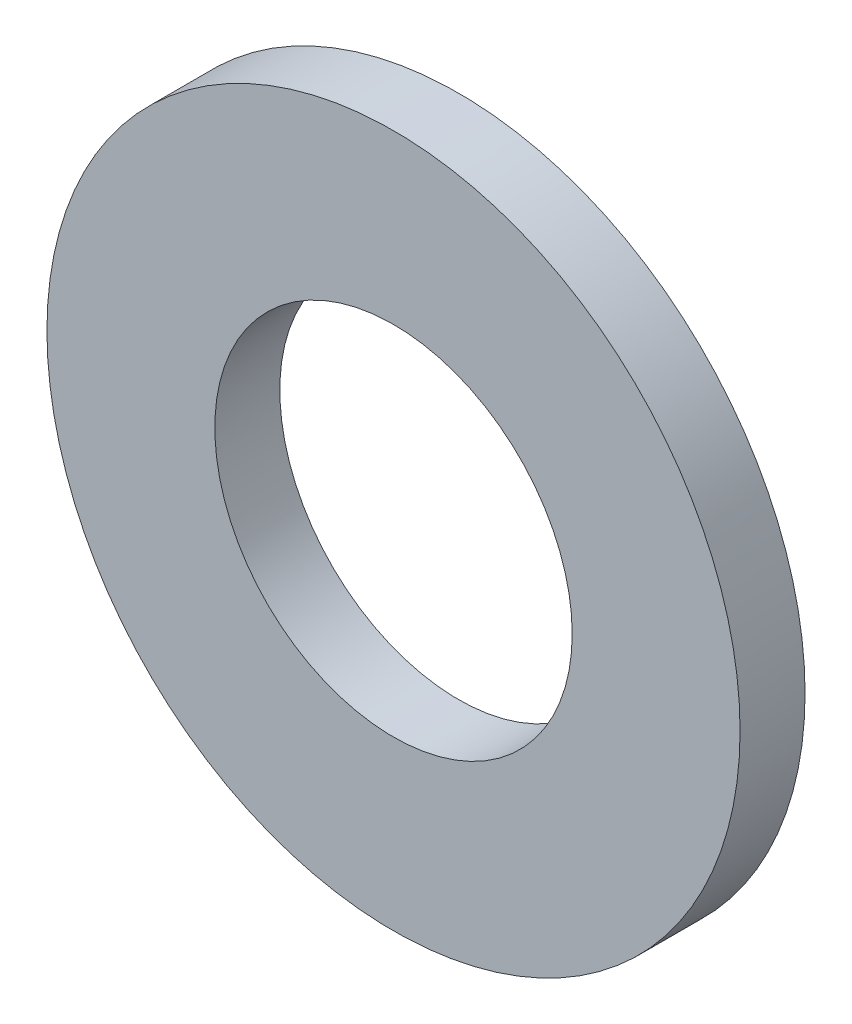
ISO-10303-21;
HEADER;
FILE_DESCRIPTION(('STEP AP214'),'2;1');
FILE_NAME('part.step','',(''),(''),'','','');
FILE_SCHEMA(('AUTOMOTIVE_DESIGN { 1 0 10303 214 1 1 1 1 }'));
ENDSEC;
DATA;
#1=APPLICATION_CONTEXT('core data for automotive mechanical design processes');
#2=APPLICATION_PROTOCOL_DEFINITION('international standard','automotive_design',2000,#1);
#3=PRODUCT_CONTEXT('',#1,'mechanical');
#4=PRODUCT('Part','Part','',(#3));
#5=PRODUCT_RELATED_PRODUCT_CATEGORY('part','',(#4));
#6=PRODUCT_DEFINITION_FORMATION('','',#4);
#7=PRODUCT_DEFINITION_CONTEXT('part definition',#1,'design');
#8=PRODUCT_DEFINITION('design','',#6,#7);
#9=PRODUCT_DEFINITION_SHAPE('','',#8);
#10=(LENGTH_UNIT() NAMED_UNIT(*) SI_UNIT(.MILLI.,.METRE.));
#11=(NAMED_UNIT(*) PLANE_ANGLE_UNIT() SI_UNIT($,.RADIAN.));
#12=(NAMED_UNIT(*) SI_UNIT($,.STERADIAN.) SOLID_ANGLE_UNIT());
#13=UNCERTAINTY_MEASURE_WITH_UNIT(LENGTH_MEASURE(1.E-05),#10,'distance_accuracy_value','');
#14=(GEOMETRIC_REPRESENTATION_CONTEXT(3) GLOBAL_UNCERTAINTY_ASSIGNED_CONTEXT((#13)) GLOBAL_UNIT_ASSIGNED_CONTEXT((#10,
#11,#12)) REPRESENTATION_CONTEXT('',''));
#15=CARTESIAN_POINT('',(0.,0.,0.));
#16=DIRECTION('',(0.,0.,1.));
#17=DIRECTION('',(1.,0.,0.));
#18=AXIS2_PLACEMENT_3D('',#15,#16,#17);
#19=CARTESIAN_POINT('',(0.,0.,2.99999999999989));
#20=DIRECTION('',(0.,0.,1.));
#21=DIRECTION('',(1.,0.,0.));
#22=AXIS2_PLACEMENT_3D('',#19,#20,#21);
#23=PLANE('',#22);
#24=CARTESIAN_POINT('',(0.,0.,2.99999999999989));
#25=DIRECTION('',(0.,0.,1.));
#26=DIRECTION('',(1.,0.,0.));
#27=AXIS2_PLACEMENT_3D('',#24,#25,#26);
#28=CIRCLE('',#27,16.);
#29=CARTESIAN_POINT('',(16.,0.,2.99999999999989));
#30=VERTEX_POINT('',#29);
#31=EDGE_CURVE('E10',#30,#30,#28,.T.);
#32=ORIENTED_EDGE('',*,*,#31,.T.);
#33=EDGE_LOOP('',(#32));
#34=FACE_BOUND('',#33,.T.);
#35=CARTESIAN_POINT('',(0.,0.,2.99999999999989));
#36=DIRECTION('',(0.,0.,1.));
#37=DIRECTION('',(1.,0.,0.));
#38=AXIS2_PLACEMENT_3D('',#35,#36,#37);
#39=CIRCLE('',#38,8.25);
#40=CARTESIAN_POINT('',(8.25000000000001,0.,2.99999999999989));
#41=VERTEX_POINT('',#40);
#42=EDGE_CURVE('E50',#41,#41,#39,.T.);
#43=ORIENTED_EDGE('',*,*,#42,.F.);
#44=EDGE_LOOP('',(#43));
#45=FACE_BOUND('',#44,.T.);
#46=ADVANCED_FACE('F36',(#34,#45),#23,.T.);
#47=CARTESIAN_POINT('',(0.,0.,0.));
#48=DIRECTION('',(0.,0.,1.));
#49=DIRECTION('',(1.,0.,0.));
#50=AXIS2_PLACEMENT_3D('',#47,#48,#49);
#51=PLANE('',#50);
#52=CARTESIAN_POINT('',(0.,0.,0.));
#53=DIRECTION('',(0.,0.,1.));
#54=DIRECTION('',(1.,0.,0.));
#55=AXIS2_PLACEMENT_3D('',#52,#53,#54);
#56=CIRCLE('',#55,16.);
#57=CARTESIAN_POINT('',(16.,0.,0.));
#58=VERTEX_POINT('',#57);
#59=EDGE_CURVE('E44',#58,#58,#56,.T.);
#60=ORIENTED_EDGE('',*,*,#59,.F.);
#61=EDGE_LOOP('',(#60));
#62=FACE_BOUND('',#61,.T.);
#63=CARTESIAN_POINT('',(0.,0.,0.));
#64=DIRECTION('',(0.,0.,1.));
#65=DIRECTION('',(1.,0.,0.));
#66=AXIS2_PLACEMENT_3D('',#63,#64,#65);
#67=CIRCLE('',#66,8.25);
#68=CARTESIAN_POINT('',(8.25000000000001,0.,0.));
#69=VERTEX_POINT('',#68);
#70=EDGE_CURVE('E55',#69,#69,#67,.T.);
#71=ORIENTED_EDGE('',*,*,#70,.T.);
#72=EDGE_LOOP('',(#71));
#73=FACE_BOUND('',#72,.T.);
#74=ADVANCED_FACE('F61',(#62,#73),#51,.F.);
#75=CARTESIAN_POINT('',(0.,0.,2.99999999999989));
#76=DIRECTION('',(0.,0.,-1.));
#77=DIRECTION('',(-1.,0.,0.));
#78=AXIS2_PLACEMENT_3D('',#75,#76,#77);
#79=CYLINDRICAL_SURFACE('',#78,16.);
#80=ORIENTED_EDGE('',*,*,#31,.F.);
#81=EDGE_LOOP('',(#80));
#82=FACE_BOUND('',#81,.T.);
#83=ORIENTED_EDGE('',*,*,#59,.T.);
#84=EDGE_LOOP('',(#83));
#85=FACE_BOUND('',#84,.T.);
#86=ADVANCED_FACE('F38',(#82,#85),#79,.T.);
#87=CARTESIAN_POINT('',(0.,0.,2.99999999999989));
#88=DIRECTION('',(0.,0.,-1.));
#89=DIRECTION('',(-1.,0.,0.));
#90=AXIS2_PLACEMENT_3D('',#87,#88,#89);
#91=CYLINDRICAL_SURFACE('',#90,8.25);
#92=ORIENTED_EDGE('',*,*,#42,.T.);
#93=EDGE_LOOP('',(#92));
#94=FACE_BOUND('',#93,.T.);
#95=ORIENTED_EDGE('',*,*,#70,.F.);
#96=EDGE_LOOP('',(#95));
#97=FACE_BOUND('',#96,.T.);
#98=ADVANCED_FACE('F63',(#94,#97),#91,.F.);
#99=CLOSED_SHELL('',(#46,#74,#86,#98));
#100=MANIFOLD_SOLID_BREP('B2',#99);
#101=ADVANCED_BREP_SHAPE_REPRESENTATION('',(#18,#100),#14);
#102=SHAPE_DEFINITION_REPRESENTATION(#9,#101);
ENDSEC;
END-ISO-10303-21;
